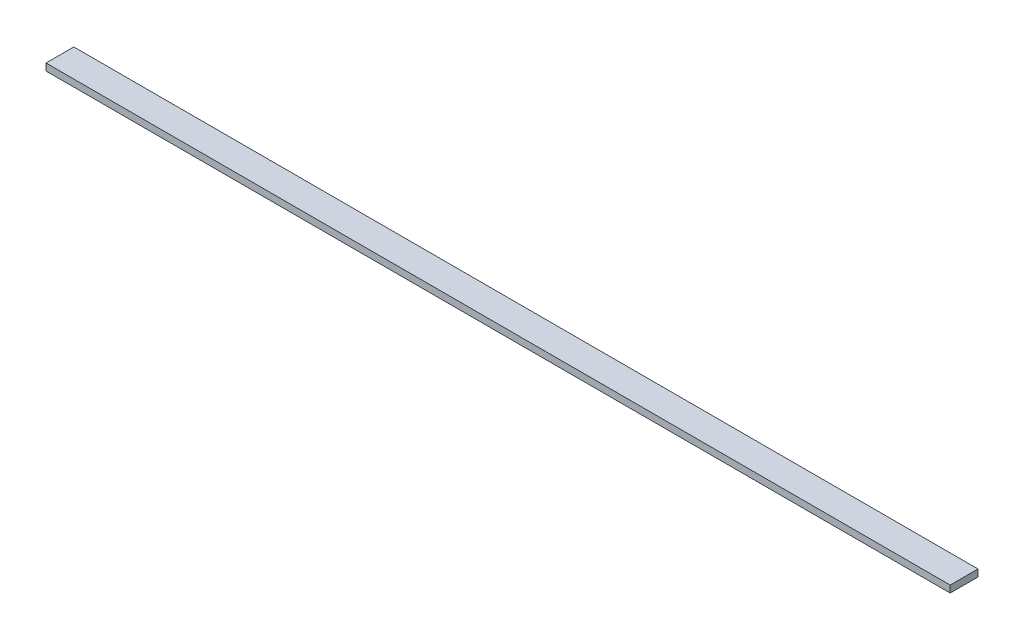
from build123d import *

# Parameters (mm, degrees)
SKETCH1_W           = 825.5
SKETCH1_H           = 25.4
BOSS_EXTRUDE1_DEPTH = 6.35


with BuildPart() as part:
    # Sketch1 → Boss-Extrude1 (new body)
    with BuildSketch(Plane(origin=(0, 0, 0), x_dir=(1, 0, 0), z_dir=(0, 1, 0))):
        Rectangle(SKETCH1_W, SKETCH1_H)
    extrude(amount=BOSS_EXTRUDE1_DEPTH)


solid = part.part
